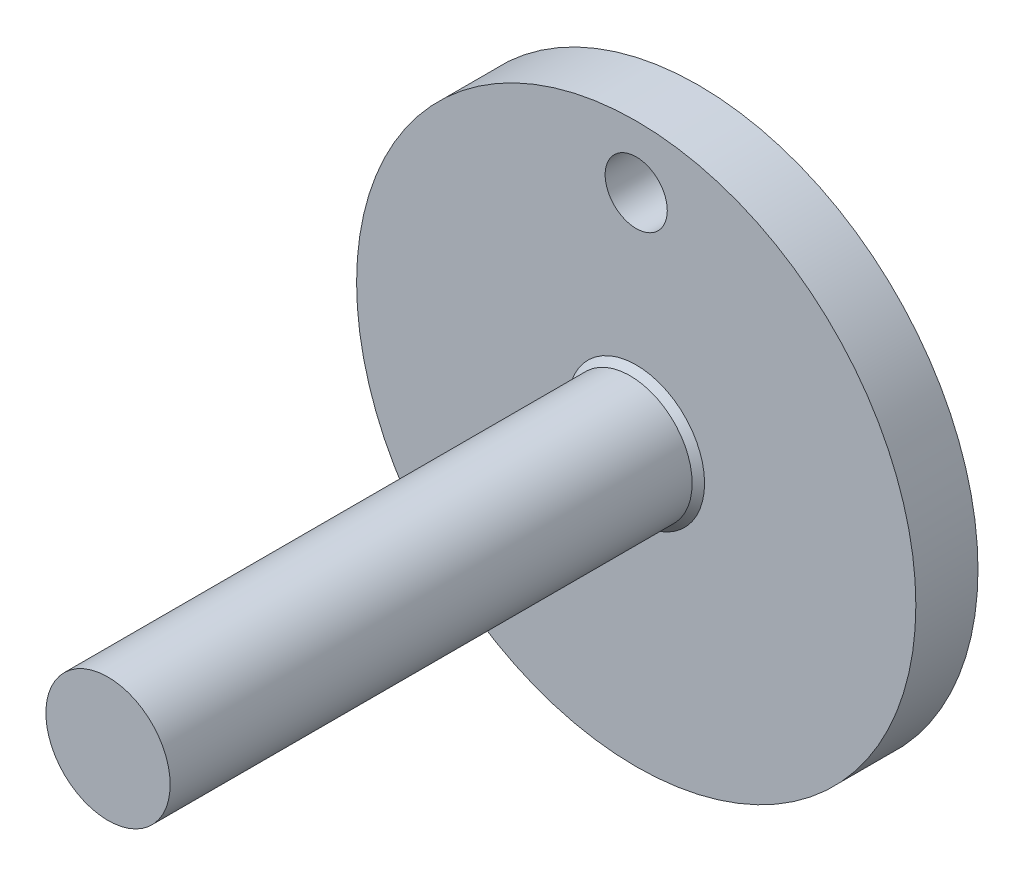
ISO-10303-21;
HEADER;
FILE_DESCRIPTION(('STEP AP214'),'2;1');
FILE_NAME('part.step','',(''),(''),'','','');
FILE_SCHEMA(('AUTOMOTIVE_DESIGN { 1 0 10303 214 1 1 1 1 }'));
ENDSEC;
DATA;
#1=APPLICATION_CONTEXT('core data for automotive mechanical design processes');
#2=APPLICATION_PROTOCOL_DEFINITION('international standard','automotive_design',2000,#1);
#3=PRODUCT_CONTEXT('',#1,'mechanical');
#4=PRODUCT('Part','Part','',(#3));
#5=PRODUCT_RELATED_PRODUCT_CATEGORY('part','',(#4));
#6=PRODUCT_DEFINITION_FORMATION('','',#4);
#7=PRODUCT_DEFINITION_CONTEXT('part definition',#1,'design');
#8=PRODUCT_DEFINITION('design','',#6,#7);
#9=PRODUCT_DEFINITION_SHAPE('','',#8);
#10=(LENGTH_UNIT() NAMED_UNIT(*) SI_UNIT(.MILLI.,.METRE.));
#11=(NAMED_UNIT(*) PLANE_ANGLE_UNIT() SI_UNIT($,.RADIAN.));
#12=(NAMED_UNIT(*) SI_UNIT($,.STERADIAN.) SOLID_ANGLE_UNIT());
#13=UNCERTAINTY_MEASURE_WITH_UNIT(LENGTH_MEASURE(1.E-05),#10,'distance_accuracy_value','');
#14=(GEOMETRIC_REPRESENTATION_CONTEXT(3) GLOBAL_UNCERTAINTY_ASSIGNED_CONTEXT((#13)) GLOBAL_UNIT_ASSIGNED_CONTEXT((#10,
#11,#12)) REPRESENTATION_CONTEXT('',''));
#15=CARTESIAN_POINT('',(0.,0.,0.));
#16=DIRECTION('',(0.,0.,1.));
#17=DIRECTION('',(1.,0.,0.));
#18=AXIS2_PLACEMENT_3D('',#15,#16,#17);
#19=CARTESIAN_POINT('',(0.,0.,10.));
#20=DIRECTION('',(0.,0.,1.));
#21=DIRECTION('',(1.,0.,0.));
#22=AXIS2_PLACEMENT_3D('',#19,#20,#21);
#23=PLANE('',#22);
#24=CARTESIAN_POINT('',(0.,0.,10.));
#25=DIRECTION('',(0.,0.,1.));
#26=DIRECTION('',(1.,0.,0.));
#27=AXIS2_PLACEMENT_3D('',#24,#25,#26);
#28=CIRCLE('',#27,11.);
#29=CARTESIAN_POINT('',(11.,0.,10.));
#30=VERTEX_POINT('',#29);
#31=EDGE_CURVE('E10',#30,#30,#28,.F.);
#32=ORIENTED_EDGE('',*,*,#31,.T.);
#33=EDGE_LOOP('',(#32));
#34=FACE_BOUND('',#33,.T.);
#35=CARTESIAN_POINT('',(0.,0.,10.));
#36=DIRECTION('',(0.,0.,1.));
#37=DIRECTION('',(1.,0.,0.));
#38=AXIS2_PLACEMENT_3D('',#35,#36,#37);
#39=CIRCLE('',#38,45.);
#40=CARTESIAN_POINT('',(45.,0.,10.));
#41=VERTEX_POINT('',#40);
#42=EDGE_CURVE('E49',#41,#41,#39,.T.);
#43=ORIENTED_EDGE('',*,*,#42,.T.);
#44=EDGE_LOOP('',(#43));
#45=FACE_BOUND('',#44,.T.);
#46=CARTESIAN_POINT('',(0.,35.,10.));
#47=DIRECTION('',(0.,0.,1.));
#48=DIRECTION('',(1.,0.,0.));
#49=AXIS2_PLACEMENT_3D('',#46,#47,#48);
#50=CIRCLE('',#49,5.);
#51=CARTESIAN_POINT('',(5.,35.,10.));
#52=VERTEX_POINT('',#51);
#53=EDGE_CURVE('E57',#52,#52,#50,.T.);
#54=ORIENTED_EDGE('',*,*,#53,.F.);
#55=EDGE_LOOP('',(#54));
#56=FACE_BOUND('',#55,.T.);
#57=ADVANCED_FACE('F37',(#34,#45,#56),#23,.T.);
#58=CARTESIAN_POINT('',(0.,0.,0.));
#59=DIRECTION('',(0.,0.,1.));
#60=DIRECTION('',(1.,0.,0.));
#61=AXIS2_PLACEMENT_3D('',#58,#59,#60);
#62=PLANE('',#61);
#63=CARTESIAN_POINT('',(0.,0.,0.));
#64=DIRECTION('',(0.,0.,1.));
#65=DIRECTION('',(1.,0.,0.));
#66=AXIS2_PLACEMENT_3D('',#63,#64,#65);
#67=CIRCLE('',#66,45.);
#68=CARTESIAN_POINT('',(45.,0.,0.));
#69=VERTEX_POINT('',#68);
#70=EDGE_CURVE('E53',#69,#69,#67,.T.);
#71=ORIENTED_EDGE('',*,*,#70,.F.);
#72=EDGE_LOOP('',(#71));
#73=FACE_BOUND('',#72,.T.);
#74=CARTESIAN_POINT('',(0.,35.,0.));
#75=DIRECTION('',(0.,0.,1.));
#76=DIRECTION('',(1.,0.,0.));
#77=AXIS2_PLACEMENT_3D('',#74,#75,#76);
#78=CIRCLE('',#77,5.);
#79=CARTESIAN_POINT('',(5.,35.,0.));
#80=VERTEX_POINT('',#79);
#81=EDGE_CURVE('E59',#80,#80,#78,.T.);
#82=ORIENTED_EDGE('',*,*,#81,.T.);
#83=EDGE_LOOP('',(#82));
#84=FACE_BOUND('',#83,.T.);
#85=ADVANCED_FACE('F83',(#73,#84),#62,.F.);
#86=CARTESIAN_POINT('',(0.,0.,10.));
#87=DIRECTION('',(0.,0.,-1.));
#88=DIRECTION('',(-1.,0.,0.));
#89=AXIS2_PLACEMENT_3D('',#86,#87,#88);
#90=CYLINDRICAL_SURFACE('',#89,45.);
#91=ORIENTED_EDGE('',*,*,#42,.F.);
#92=EDGE_LOOP('',(#91));
#93=FACE_BOUND('',#92,.T.);
#94=ORIENTED_EDGE('',*,*,#70,.T.);
#95=EDGE_LOOP('',(#94));
#96=FACE_BOUND('',#95,.T.);
#97=ADVANCED_FACE('F79',(#93,#96),#90,.T.);
#98=CARTESIAN_POINT('',(0.,35.,10.));
#99=DIRECTION('',(0.,0.,-1.));
#100=DIRECTION('',(-1.,0.,0.));
#101=AXIS2_PLACEMENT_3D('',#98,#99,#100);
#102=CYLINDRICAL_SURFACE('',#101,5.);
#103=ORIENTED_EDGE('',*,*,#53,.T.);
#104=EDGE_LOOP('',(#103));
#105=FACE_BOUND('',#104,.T.);
#106=ORIENTED_EDGE('',*,*,#81,.F.);
#107=EDGE_LOOP('',(#106));
#108=FACE_BOUND('',#107,.T.);
#109=ADVANCED_FACE('F72',(#105,#108),#102,.F.);
#110=CARTESIAN_POINT('',(0.,0.,95.));
#111=DIRECTION('',(0.,0.,-1.));
#112=DIRECTION('',(-1.,0.,0.));
#113=AXIS2_PLACEMENT_3D('',#110,#111,#112);
#114=CYLINDRICAL_SURFACE('',#113,10.);
#115=CARTESIAN_POINT('',(0.,0.,11.));
#116=DIRECTION('',(0.,0.,1.));
#117=DIRECTION('',(1.,0.,0.));
#118=AXIS2_PLACEMENT_3D('',#115,#116,#117);
#119=CIRCLE('',#118,10.);
#120=CARTESIAN_POINT('',(10.,0.,11.));
#121=VERTEX_POINT('',#120);
#122=EDGE_CURVE('E45',#121,#121,#119,.T.);
#123=ORIENTED_EDGE('',*,*,#122,.T.);
#124=EDGE_LOOP('',(#123));
#125=FACE_BOUND('',#124,.T.);
#126=CARTESIAN_POINT('',(0.,0.,95.));
#127=DIRECTION('',(0.,0.,1.));
#128=DIRECTION('',(1.,0.,0.));
#129=AXIS2_PLACEMENT_3D('',#126,#127,#128);
#130=CIRCLE('',#129,10.);
#131=CARTESIAN_POINT('',(10.,0.,95.));
#132=VERTEX_POINT('',#131);
#133=EDGE_CURVE('E62',#132,#132,#130,.T.);
#134=ORIENTED_EDGE('',*,*,#133,.F.);
#135=EDGE_LOOP('',(#134));
#136=FACE_BOUND('',#135,.T.);
#137=ADVANCED_FACE('F70',(#125,#136),#114,.T.);
#138=CARTESIAN_POINT('',(0.,0.,95.));
#139=DIRECTION('',(0.,0.,1.));
#140=DIRECTION('',(1.,0.,0.));
#141=AXIS2_PLACEMENT_3D('',#138,#139,#140);
#142=PLANE('',#141);
#143=ORIENTED_EDGE('',*,*,#133,.T.);
#144=EDGE_LOOP('',(#143));
#145=FACE_BOUND('',#144,.T.);
#146=ADVANCED_FACE('F68',(#145),#142,.T.);
#147=CARTESIAN_POINT('',(0.,0.,11.));
#148=DIRECTION('',(0.,0.,-1.));
#149=DIRECTION('',(-1.,0.,0.));
#150=AXIS2_PLACEMENT_3D('',#147,#148,#149);
#151=CONICAL_SURFACE('',#150,10.,0.785398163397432);
#152=ORIENTED_EDGE('',*,*,#31,.F.);
#153=EDGE_LOOP('',(#152));
#154=FACE_BOUND('',#153,.T.);
#155=ORIENTED_EDGE('',*,*,#122,.F.);
#156=EDGE_LOOP('',(#155));
#157=FACE_BOUND('',#156,.T.);
#158=ADVANCED_FACE('F40',(#154,#157),#151,.T.);
#159=CLOSED_SHELL('',(#57,#85,#97,#109,#137,#146,#158));
#160=MANIFOLD_SOLID_BREP('B2',#159);
#161=ADVANCED_BREP_SHAPE_REPRESENTATION('',(#18,#160),#14);
#162=SHAPE_DEFINITION_REPRESENTATION(#9,#161);
ENDSEC;
END-ISO-10303-21;
